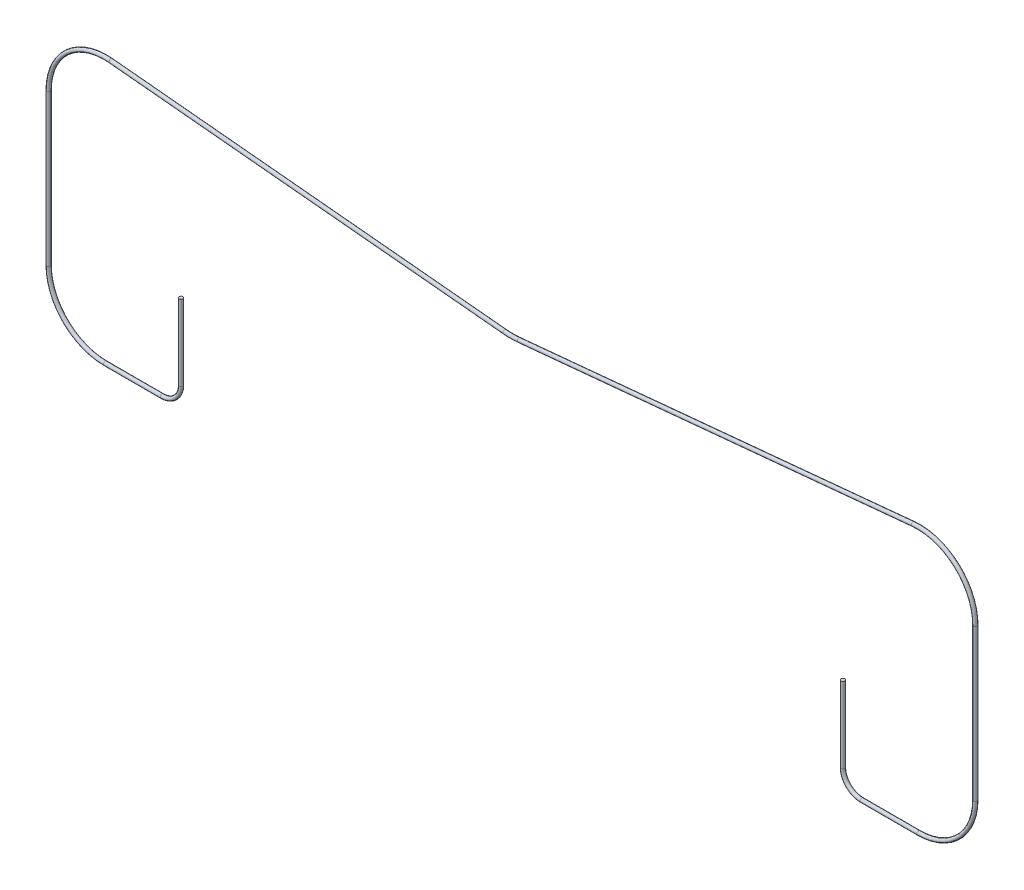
from build123d import *

# Parameters (mm, degrees)
ESQUISSE2_R             = 0.1
ESQUISSE3_W             = 38.111041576
ESQUISSE3_H             = 5.046534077
ENL_V_MAT_EXTRU_1_DEPTH = 5


with BuildPart() as part:
    # Balayage1: sweep along a path in Esquisse1
    with BuildLine(Plane.XY) as balayage1_path:
        Line((0, -4), (0, 4.013707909))
        ThreePointArc((0, 4.013707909), (0.982257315, 6.233778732), (3.285809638, 7.000062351))
        Line((3.285809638, 7.000062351), (24.118920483, 5.006225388))
        ThreePointArc((24.118920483, 5.006225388), (24.5, 4.98803131), (24.881079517, 5.006225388))
        Line((24.881079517, 5.006225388), (45.714190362, 7.000062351))
        ThreePointArc((45.714190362, 7.000062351), (48.017742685, 6.233778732), (49, 4.013707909))
        Line((49, 4.013707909), (49, -4))
        ThreePointArc((49, -4), (48.121320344, -6.121320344), (46, -7))
        Line((46, -7), (43, -7))
        ThreePointArc((43, -7), (42.292893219, -6.707106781), (42, -6))
        Line((42, -6), (42, 1))
        ThreePointArc((42, 1), (41.707106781, 1.707106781), (41, 2))
        Line((41, 2), (8, 2))
        ThreePointArc((8, 2), (7.292893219, 1.707106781), (7, 1))
        Line((7, 1), (7, -6))
        ThreePointArc((7, -6), (6.707106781, -6.707106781), (6, -7))
        Line((6, -7), (3, -7))
        ThreePointArc((3, -7), (0.878679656, -6.121320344), (0, -4))
    # Esquisse2 → Balayage1 (sweep)
    with BuildSketch(Plane(origin=(0, 0, 0), x_dir=(1, 0, 0), z_dir=(0, 1, 0))):
        Circle(ESQUISSE2_R)
    sweep(path=balayage1_path.line)

    # Esquisse3 → Enl_v. mat.-Extru.1 (cut, symmetric)
    with BuildSketch(Plane.XY):
        with Locations((24.254715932, 0.523267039)):
            Rectangle(ESQUISSE3_W, ESQUISSE3_H)
    extrude(amount=ENL_V_MAT_EXTRU_1_DEPTH, both=True, mode=Mode.SUBTRACT)


solid = part.part
